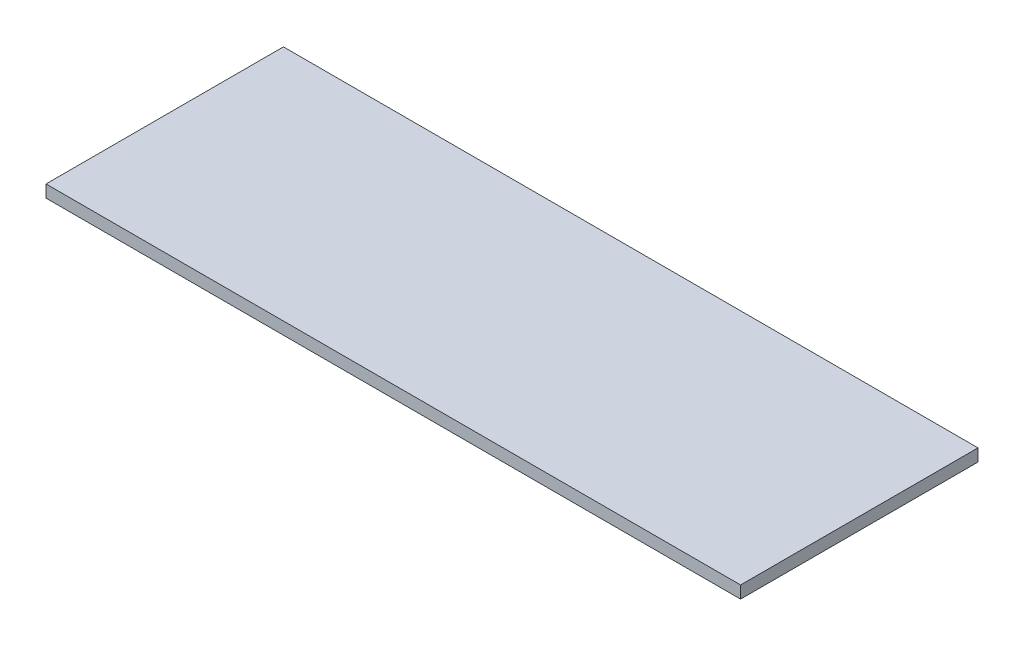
ISO-10303-21;
HEADER;
FILE_DESCRIPTION(('STEP AP214'),'2;1');
FILE_NAME('part.step','',(''),(''),'','','');
FILE_SCHEMA(('AUTOMOTIVE_DESIGN { 1 0 10303 214 1 1 1 1 }'));
ENDSEC;
DATA;
#1=APPLICATION_CONTEXT('core data for automotive mechanical design processes');
#2=APPLICATION_PROTOCOL_DEFINITION('international standard','automotive_design',2000,#1);
#3=PRODUCT_CONTEXT('',#1,'mechanical');
#4=PRODUCT('Part','Part','',(#3));
#5=PRODUCT_RELATED_PRODUCT_CATEGORY('part','',(#4));
#6=PRODUCT_DEFINITION_FORMATION('','',#4);
#7=PRODUCT_DEFINITION_CONTEXT('part definition',#1,'design');
#8=PRODUCT_DEFINITION('design','',#6,#7);
#9=PRODUCT_DEFINITION_SHAPE('','',#8);
#10=(LENGTH_UNIT() NAMED_UNIT(*) SI_UNIT(.MILLI.,.METRE.));
#11=(NAMED_UNIT(*) PLANE_ANGLE_UNIT() SI_UNIT($,.RADIAN.));
#12=(NAMED_UNIT(*) SI_UNIT($,.STERADIAN.) SOLID_ANGLE_UNIT());
#13=UNCERTAINTY_MEASURE_WITH_UNIT(LENGTH_MEASURE(1.E-05),#10,'distance_accuracy_value','');
#14=(GEOMETRIC_REPRESENTATION_CONTEXT(3) GLOBAL_UNCERTAINTY_ASSIGNED_CONTEXT((#13)) GLOBAL_UNIT_ASSIGNED_CONTEXT((#10,
#11,#12)) REPRESENTATION_CONTEXT('',''));
#15=CARTESIAN_POINT('',(0.,0.,0.));
#16=DIRECTION('',(0.,0.,1.));
#17=DIRECTION('',(1.,0.,0.));
#18=AXIS2_PLACEMENT_3D('',#15,#16,#17);
#19=CARTESIAN_POINT('',(82.55,2.921,-28.2194));
#20=DIRECTION('',(-1.,0.,0.));
#21=DIRECTION('',(0.,0.,1.));
#22=AXIS2_PLACEMENT_3D('',#19,#20,#21);
#23=PLANE('',#22);
#24=DIRECTION('',(0.,0.,-1.));
#25=VECTOR('',#24,1.);
#26=CARTESIAN_POINT('',(82.55,0.,-28.2194));
#27=LINE('',#26,#25);
#28=CARTESIAN_POINT('',(82.55,0.,28.2194));
#29=VERTEX_POINT('',#28);
#30=CARTESIAN_POINT('',(82.55,0.,-28.2194));
#31=VERTEX_POINT('',#30);
#32=EDGE_CURVE('E96',#29,#31,#27,.T.);
#33=ORIENTED_EDGE('',*,*,#32,.T.);
#34=DIRECTION('',(0.,-1.,0.));
#35=VECTOR('',#34,1.);
#36=CARTESIAN_POINT('',(82.55,2.921,-28.2194));
#37=LINE('',#36,#35);
#38=CARTESIAN_POINT('',(82.55,2.921,-28.2194));
#39=VERTEX_POINT('',#38);
#40=EDGE_CURVE('E11',#39,#31,#37,.T.);
#41=ORIENTED_EDGE('',*,*,#40,.F.);
#42=DIRECTION('',(0.,0.,-1.));
#43=VECTOR('',#42,1.);
#44=CARTESIAN_POINT('',(82.55,2.921,-28.2194));
#45=LINE('',#44,#43);
#46=CARTESIAN_POINT('',(82.55,2.921,28.2194));
#47=VERTEX_POINT('',#46);
#48=EDGE_CURVE('E84',#47,#39,#45,.T.);
#49=ORIENTED_EDGE('',*,*,#48,.F.);
#50=DIRECTION('',(0.,-1.,0.));
#51=VECTOR('',#50,1.);
#52=CARTESIAN_POINT('',(82.55,2.921,28.2194));
#53=LINE('',#52,#51);
#54=EDGE_CURVE('E92',#47,#29,#53,.T.);
#55=ORIENTED_EDGE('',*,*,#54,.T.);
#56=EDGE_LOOP('',(#33,#41,#49,#55));
#57=FACE_BOUND('',#56,.T.);
#58=ADVANCED_FACE('F33',(#57),#23,.F.);
#59=CARTESIAN_POINT('',(-82.55,2.921,-28.2194));
#60=DIRECTION('',(0.,0.,1.));
#61=DIRECTION('',(1.,0.,0.));
#62=AXIS2_PLACEMENT_3D('',#59,#60,#61);
#63=PLANE('',#62);
#64=DIRECTION('',(-1.,0.,0.));
#65=VECTOR('',#64,1.);
#66=CARTESIAN_POINT('',(-82.55,0.,-28.2194));
#67=LINE('',#66,#65);
#68=CARTESIAN_POINT('',(-82.55,0.,-28.2194));
#69=VERTEX_POINT('',#68);
#70=EDGE_CURVE('E88',#31,#69,#67,.T.);
#71=ORIENTED_EDGE('',*,*,#70,.T.);
#72=DIRECTION('',(0.,-1.,0.));
#73=VECTOR('',#72,1.);
#74=CARTESIAN_POINT('',(-82.55,2.921,-28.2194));
#75=LINE('',#74,#73);
#76=CARTESIAN_POINT('',(-82.55,2.921,-28.2194));
#77=VERTEX_POINT('',#76);
#78=EDGE_CURVE('E41',#77,#69,#75,.T.);
#79=ORIENTED_EDGE('',*,*,#78,.F.);
#80=DIRECTION('',(-1.,0.,0.));
#81=VECTOR('',#80,1.);
#82=CARTESIAN_POINT('',(-82.55,2.921,-28.2194));
#83=LINE('',#82,#81);
#84=EDGE_CURVE('E79',#39,#77,#83,.T.);
#85=ORIENTED_EDGE('',*,*,#84,.F.);
#86=ORIENTED_EDGE('',*,*,#40,.T.);
#87=EDGE_LOOP('',(#71,#79,#85,#86));
#88=FACE_BOUND('',#87,.T.);
#89=ADVANCED_FACE('F87',(#88),#63,.F.);
#90=CARTESIAN_POINT('',(-82.55,2.921,-28.2194));
#91=DIRECTION('',(1.,0.,0.));
#92=DIRECTION('',(0.,0.,-1.));
#93=AXIS2_PLACEMENT_3D('',#90,#91,#92);
#94=PLANE('',#93);
#95=DIRECTION('',(0.,0.,1.));
#96=VECTOR('',#95,1.);
#97=CARTESIAN_POINT('',(-82.55,0.,-28.2194));
#98=LINE('',#97,#96);
#99=CARTESIAN_POINT('',(-82.55,0.,28.2194));
#100=VERTEX_POINT('',#99);
#101=EDGE_CURVE('E66',#69,#100,#98,.T.);
#102=ORIENTED_EDGE('',*,*,#101,.T.);
#103=DIRECTION('',(0.,-1.,0.));
#104=VECTOR('',#103,1.);
#105=CARTESIAN_POINT('',(-82.55,2.921,28.2194));
#106=LINE('',#105,#104);
#107=CARTESIAN_POINT('',(-82.55,2.921,28.2194));
#108=VERTEX_POINT('',#107);
#109=EDGE_CURVE('E89',#108,#100,#106,.T.);
#110=ORIENTED_EDGE('',*,*,#109,.F.);
#111=DIRECTION('',(0.,0.,1.));
#112=VECTOR('',#111,1.);
#113=CARTESIAN_POINT('',(-82.55,2.921,-28.2194));
#114=LINE('',#113,#112);
#115=EDGE_CURVE('E82',#77,#108,#114,.T.);
#116=ORIENTED_EDGE('',*,*,#115,.F.);
#117=ORIENTED_EDGE('',*,*,#78,.T.);
#118=EDGE_LOOP('',(#102,#110,#116,#117));
#119=FACE_BOUND('',#118,.T.);
#120=ADVANCED_FACE('F90',(#119),#94,.F.);
#121=CARTESIAN_POINT('',(-82.55,2.921,28.2194));
#122=DIRECTION('',(0.,0.,-1.));
#123=DIRECTION('',(-1.,0.,0.));
#124=AXIS2_PLACEMENT_3D('',#121,#122,#123);
#125=PLANE('',#124);
#126=DIRECTION('',(1.,0.,0.));
#127=VECTOR('',#126,1.);
#128=CARTESIAN_POINT('',(-82.55,0.,28.2194));
#129=LINE('',#128,#127);
#130=EDGE_CURVE('E72',#100,#29,#129,.T.);
#131=ORIENTED_EDGE('',*,*,#130,.T.);
#132=ORIENTED_EDGE('',*,*,#54,.F.);
#133=DIRECTION('',(1.,0.,0.));
#134=VECTOR('',#133,1.);
#135=CARTESIAN_POINT('',(-82.55,2.921,28.2194));
#136=LINE('',#135,#134);
#137=EDGE_CURVE('E49',#108,#47,#136,.T.);
#138=ORIENTED_EDGE('',*,*,#137,.F.);
#139=ORIENTED_EDGE('',*,*,#109,.T.);
#140=EDGE_LOOP('',(#131,#132,#138,#139));
#141=FACE_BOUND('',#140,.T.);
#142=ADVANCED_FACE('F103',(#141),#125,.F.);
#143=CARTESIAN_POINT('',(0.,2.921,0.));
#144=DIRECTION('',(0.,1.,0.));
#145=DIRECTION('',(0.,0.,1.));
#146=AXIS2_PLACEMENT_3D('',#143,#144,#145);
#147=PLANE('',#146);
#148=ORIENTED_EDGE('',*,*,#48,.T.);
#149=ORIENTED_EDGE('',*,*,#84,.T.);
#150=ORIENTED_EDGE('',*,*,#115,.T.);
#151=ORIENTED_EDGE('',*,*,#137,.T.);
#152=EDGE_LOOP('',(#148,#149,#150,#151));
#153=FACE_BOUND('',#152,.T.);
#154=ADVANCED_FACE('F80',(#153),#147,.T.);
#155=CARTESIAN_POINT('',(0.,0.,0.));
#156=DIRECTION('',(0.,1.,0.));
#157=DIRECTION('',(0.,0.,1.));
#158=AXIS2_PLACEMENT_3D('',#155,#156,#157);
#159=PLANE('',#158);
#160=ORIENTED_EDGE('',*,*,#32,.F.);
#161=ORIENTED_EDGE('',*,*,#130,.F.);
#162=ORIENTED_EDGE('',*,*,#101,.F.);
#163=ORIENTED_EDGE('',*,*,#70,.F.);
#164=EDGE_LOOP('',(#160,#161,#162,#163));
#165=FACE_BOUND('',#164,.T.);
#166=ADVANCED_FACE('F106',(#165),#159,.F.);
#167=CLOSED_SHELL('',(#58,#89,#120,#142,#154,#166));
#168=MANIFOLD_SOLID_BREP('B2',#167);
#169=ADVANCED_BREP_SHAPE_REPRESENTATION('',(#18,#168),#14);
#170=SHAPE_DEFINITION_REPRESENTATION(#9,#169);
ENDSEC;
END-ISO-10303-21;
